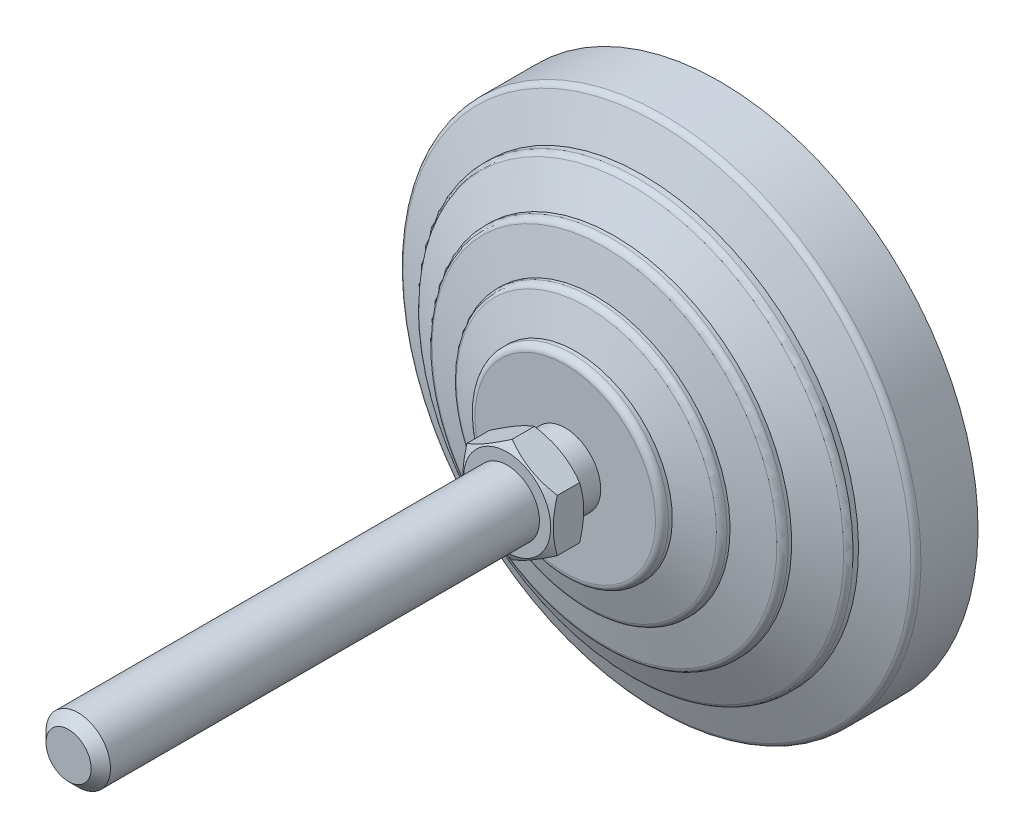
ISO-10303-21;
HEADER;
FILE_DESCRIPTION(('STEP AP214'),'2;1');
FILE_NAME('part.step','',(''),(''),'','','');
FILE_SCHEMA(('AUTOMOTIVE_DESIGN { 1 0 10303 214 1 1 1 1 }'));
ENDSEC;
DATA;
#1=APPLICATION_CONTEXT('core data for automotive mechanical design processes');
#2=APPLICATION_PROTOCOL_DEFINITION('international standard','automotive_design',2000,#1);
#3=PRODUCT_CONTEXT('',#1,'mechanical');
#4=PRODUCT('Part','Part','',(#3));
#5=PRODUCT_RELATED_PRODUCT_CATEGORY('part','',(#4));
#6=PRODUCT_DEFINITION_FORMATION('','',#4);
#7=PRODUCT_DEFINITION_CONTEXT('part definition',#1,'design');
#8=PRODUCT_DEFINITION('design','',#6,#7);
#9=PRODUCT_DEFINITION_SHAPE('','',#8);
#10=(LENGTH_UNIT() NAMED_UNIT(*) SI_UNIT(.MILLI.,.METRE.));
#11=(NAMED_UNIT(*) PLANE_ANGLE_UNIT() SI_UNIT($,.RADIAN.));
#12=(NAMED_UNIT(*) SI_UNIT($,.STERADIAN.) SOLID_ANGLE_UNIT());
#13=UNCERTAINTY_MEASURE_WITH_UNIT(LENGTH_MEASURE(1.E-05),#10,'distance_accuracy_value','');
#14=(GEOMETRIC_REPRESENTATION_CONTEXT(3) GLOBAL_UNCERTAINTY_ASSIGNED_CONTEXT((#13)) GLOBAL_UNIT_ASSIGNED_CONTEXT((#10,
#11,#12)) REPRESENTATION_CONTEXT('',''));
#15=CARTESIAN_POINT('',(0.,0.,0.));
#16=DIRECTION('',(0.,0.,1.));
#17=DIRECTION('',(1.,0.,0.));
#18=AXIS2_PLACEMENT_3D('',#15,#16,#17);
#19=CARTESIAN_POINT('',(-5.50000000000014,0.,28.));
#20=DIRECTION('',(0.,0.,1.));
#21=DIRECTION('',(0.,-1.,0.));
#22=AXIS2_PLACEMENT_3D('',#19,#20,#21);
#23=PLANE('',#22);
#24=CARTESIAN_POINT('',(0.,0.,28.));
#25=DIRECTION('',(0.,0.,-1.));
#26=DIRECTION('',(-1.,0.,0.));
#27=AXIS2_PLACEMENT_3D('',#24,#25,#26);
#28=CIRCLE('',#27,6.75);
#29=CARTESIAN_POINT('',(-6.75,0.,28.));
#30=VERTEX_POINT('',#29);
#31=EDGE_CURVE('E311',#30,#30,#28,.T.);
#32=ORIENTED_EDGE('',*,*,#31,.T.);
#33=EDGE_LOOP('',(#32));
#34=FACE_BOUND('',#33,.T.);
#35=CARTESIAN_POINT('',(0.,0.,28.));
#36=DIRECTION('',(0.,0.,-1.));
#37=DIRECTION('',(0.,1.,0.));
#38=AXIS2_PLACEMENT_3D('',#35,#36,#37);
#39=CIRCLE('',#38,5.50000000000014);
#40=CARTESIAN_POINT('',(0.,5.50000000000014,28.));
#41=VERTEX_POINT('',#40);
#42=EDGE_CURVE('E150',#41,#41,#39,.T.);
#43=ORIENTED_EDGE('',*,*,#42,.F.);
#44=EDGE_LOOP('',(#43));
#45=FACE_BOUND('',#44,.T.);
#46=ADVANCED_FACE('F14',(#34,#45),#23,.F.);
#47=CARTESIAN_POINT('',(0.,0.,0.));
#48=DIRECTION('',(0.,0.,-1.));
#49=DIRECTION('',(0.,1.,0.));
#50=AXIS2_PLACEMENT_3D('',#47,#48,#49);
#51=CYLINDRICAL_SURFACE('',#50,5.50000000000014);
#52=CARTESIAN_POINT('',(0.,0.,24.));
#53=DIRECTION('',(0.,0.,-1.));
#54=DIRECTION('',(0.,1.,0.));
#55=AXIS2_PLACEMENT_3D('',#52,#53,#54);
#56=CIRCLE('',#55,5.50000000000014);
#57=CARTESIAN_POINT('',(0.,5.50000000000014,24.));
#58=VERTEX_POINT('',#57);
#59=EDGE_CURVE('E147',#58,#58,#56,.T.);
#60=ORIENTED_EDGE('',*,*,#59,.F.);
#61=EDGE_LOOP('',(#60));
#62=FACE_BOUND('',#61,.T.);
#63=ORIENTED_EDGE('',*,*,#42,.T.);
#64=EDGE_LOOP('',(#63));
#65=FACE_BOUND('',#64,.T.);
#66=ADVANCED_FACE('F178',(#62,#65),#51,.T.);
#67=CARTESIAN_POINT('',(-5.50000000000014,0.,24.));
#68=DIRECTION('',(0.,0.,-1.));
#69=DIRECTION('',(0.,1.,0.));
#70=AXIS2_PLACEMENT_3D('',#67,#68,#69);
#71=PLANE('',#70);
#72=CARTESIAN_POINT('',(0.,0.,24.));
#73=DIRECTION('',(0.,0.,-1.));
#74=DIRECTION('',(0.,1.,0.));
#75=AXIS2_PLACEMENT_3D('',#72,#73,#74);
#76=CIRCLE('',#75,14.);
#77=CARTESIAN_POINT('',(0.,14.,24.));
#78=VERTEX_POINT('',#77);
#79=EDGE_CURVE('E144',#78,#78,#76,.T.);
#80=ORIENTED_EDGE('',*,*,#79,.F.);
#81=EDGE_LOOP('',(#80));
#82=FACE_BOUND('',#81,.T.);
#83=ORIENTED_EDGE('',*,*,#59,.T.);
#84=EDGE_LOOP('',(#83));
#85=FACE_BOUND('',#84,.T.);
#86=ADVANCED_FACE('F185',(#82,#85),#71,.F.);
#87=CARTESIAN_POINT('',(0.,0.,23.));
#88=DIRECTION('',(0.,0.,-1.));
#89=DIRECTION('',(0.,1.,0.));
#90=AXIS2_PLACEMENT_3D('',#87,#88,#89);
#91=TOROIDAL_SURFACE('',#90,14.,1.);
#92=CARTESIAN_POINT('',(0.,0.,23.));
#93=DIRECTION('',(0.,0.,-1.));
#94=DIRECTION('',(0.,1.,0.));
#95=AXIS2_PLACEMENT_3D('',#92,#93,#94);
#96=CIRCLE('',#95,15.);
#97=CARTESIAN_POINT('',(0.,15.,23.));
#98=VERTEX_POINT('',#97);
#99=EDGE_CURVE('E141',#98,#98,#96,.T.);
#100=ORIENTED_EDGE('',*,*,#99,.F.);
#101=EDGE_LOOP('',(#100));
#102=FACE_BOUND('',#101,.T.);
#103=ORIENTED_EDGE('',*,*,#79,.T.);
#104=EDGE_LOOP('',(#103));
#105=FACE_BOUND('',#104,.T.);
#106=ADVANCED_FACE('F524',(#102,#105),#91,.T.);
#107=CARTESIAN_POINT('',(0.,0.,0.));
#108=DIRECTION('',(0.,0.,-1.));
#109=DIRECTION('',(0.,1.,0.));
#110=AXIS2_PLACEMENT_3D('',#107,#108,#109);
#111=CYLINDRICAL_SURFACE('',#110,15.);
#112=CARTESIAN_POINT('',(0.,0.,22.4025287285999));
#113=DIRECTION('',(0.,0.,-1.));
#114=DIRECTION('',(0.,1.,0.));
#115=AXIS2_PLACEMENT_3D('',#112,#113,#114);
#116=CIRCLE('',#115,15.);
#117=CARTESIAN_POINT('',(0.,15.,22.4025287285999));
#118=VERTEX_POINT('',#117);
#119=EDGE_CURVE('E138',#118,#118,#116,.T.);
#120=ORIENTED_EDGE('',*,*,#119,.F.);
#121=EDGE_LOOP('',(#120));
#122=FACE_BOUND('',#121,.T.);
#123=ORIENTED_EDGE('',*,*,#99,.T.);
#124=EDGE_LOOP('',(#123));
#125=FACE_BOUND('',#124,.T.);
#126=ADVANCED_FACE('F515',(#122,#125),#111,.T.);
#127=CARTESIAN_POINT('',(0.,0.,22.4025287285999));
#128=DIRECTION('',(0.,0.,-1.));
#129=DIRECTION('',(0.,1.,0.));
#130=AXIS2_PLACEMENT_3D('',#127,#128,#129);
#131=CONICAL_SURFACE('',#130,15.,1.25589726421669);
#132=CARTESIAN_POINT('',(0.,0.,20.7216684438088));
#133=DIRECTION('',(0.,0.,-1.));
#134=DIRECTION('',(0.,1.,0.));
#135=AXIS2_PLACEMENT_3D('',#132,#133,#134);
#136=CIRCLE('',#135,20.1601635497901);
#137=CARTESIAN_POINT('',(0.,20.1601635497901,20.7216684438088));
#138=VERTEX_POINT('',#137);
#139=EDGE_CURVE('E135',#138,#138,#136,.T.);
#140=ORIENTED_EDGE('',*,*,#139,.F.);
#141=EDGE_LOOP('',(#140));
#142=FACE_BOUND('',#141,.T.);
#143=ORIENTED_EDGE('',*,*,#119,.T.);
#144=EDGE_LOOP('',(#143));
#145=FACE_BOUND('',#144,.T.);
#146=ADVANCED_FACE('F506',(#142,#145),#131,.T.);
#147=CARTESIAN_POINT('',(0.,0.,19.7708407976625));
#148=DIRECTION('',(0.,0.,-1.));
#149=DIRECTION('',(0.,1.,0.));
#150=AXIS2_PLACEMENT_3D('',#147,#148,#149);
#151=TOROIDAL_SURFACE('',#150,19.8504430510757,1.);
#152=CARTESIAN_POINT('',(0.,0.,19.7708407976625));
#153=DIRECTION('',(0.,0.,-1.));
#154=DIRECTION('',(0.,1.,0.));
#155=AXIS2_PLACEMENT_3D('',#152,#153,#154);
#156=CIRCLE('',#155,20.8504430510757);
#157=CARTESIAN_POINT('',(0.,20.8504430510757,19.7708407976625));
#158=VERTEX_POINT('',#157);
#159=EDGE_CURVE('E132',#158,#158,#156,.T.);
#160=ORIENTED_EDGE('',*,*,#159,.F.);
#161=EDGE_LOOP('',(#160));
#162=FACE_BOUND('',#161,.T.);
#163=ORIENTED_EDGE('',*,*,#139,.T.);
#164=EDGE_LOOP('',(#163));
#165=FACE_BOUND('',#164,.T.);
#166=ADVANCED_FACE('F497',(#162,#165),#151,.T.);
#167=CARTESIAN_POINT('',(0.,0.,0.));
#168=DIRECTION('',(0.,0.,-1.));
#169=DIRECTION('',(0.,1.,0.));
#170=AXIS2_PLACEMENT_3D('',#167,#168,#169);
#171=CYLINDRICAL_SURFACE('',#170,20.8504430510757);
#172=CARTESIAN_POINT('',(0.,0.,19.2987385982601));
#173=DIRECTION('',(0.,0.,-1.));
#174=DIRECTION('',(0.,1.,0.));
#175=AXIS2_PLACEMENT_3D('',#172,#173,#174);
#176=CIRCLE('',#175,20.8504430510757);
#177=CARTESIAN_POINT('',(0.,20.8504430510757,19.2987385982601));
#178=VERTEX_POINT('',#177);
#179=EDGE_CURVE('E129',#178,#178,#176,.T.);
#180=ORIENTED_EDGE('',*,*,#179,.F.);
#181=EDGE_LOOP('',(#180));
#182=FACE_BOUND('',#181,.T.);
#183=ORIENTED_EDGE('',*,*,#159,.T.);
#184=EDGE_LOOP('',(#183));
#185=FACE_BOUND('',#184,.T.);
#186=ADVANCED_FACE('F488',(#182,#185),#171,.T.);
#187=CARTESIAN_POINT('',(0.,0.,19.2987385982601));
#188=DIRECTION('',(0.,0.,-1.));
#189=DIRECTION('',(0.,1.,0.));
#190=AXIS2_PLACEMENT_3D('',#187,#188,#189);
#191=CONICAL_SURFACE('',#190,20.8504430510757,1.34067144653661);
#192=CARTESIAN_POINT('',(0.,0.,17.9217501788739));
#193=DIRECTION('',(0.,0.,-1.));
#194=DIRECTION('',(0.,1.,0.));
#195=AXIS2_PLACEMENT_3D('',#192,#193,#194);
#196=CIRCLE('',#195,26.7280991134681);
#197=CARTESIAN_POINT('',(0.,26.7280991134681,17.9217501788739));
#198=VERTEX_POINT('',#197);
#199=EDGE_CURVE('E126',#198,#198,#196,.T.);
#200=ORIENTED_EDGE('',*,*,#199,.F.);
#201=EDGE_LOOP('',(#200));
#202=FACE_BOUND('',#201,.T.);
#203=ORIENTED_EDGE('',*,*,#179,.T.);
#204=EDGE_LOOP('',(#203));
#205=FACE_BOUND('',#204,.T.);
#206=ADVANCED_FACE('F479',(#202,#205),#191,.T.);
#207=CARTESIAN_POINT('',(0.,0.,16.9481122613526));
#208=DIRECTION('',(0.,0.,-1.));
#209=DIRECTION('',(0.,1.,0.));
#210=AXIS2_PLACEMENT_3D('',#207,#208,#209);
#211=TOROIDAL_SURFACE('',#210,26.5,1.);
#212=CARTESIAN_POINT('',(0.,0.,16.9481122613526));
#213=DIRECTION('',(0.,0.,-1.));
#214=DIRECTION('',(0.,1.,0.));
#215=AXIS2_PLACEMENT_3D('',#212,#213,#214);
#216=CIRCLE('',#215,27.5);
#217=CARTESIAN_POINT('',(0.,27.5,16.9481122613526));
#218=VERTEX_POINT('',#217);
#219=EDGE_CURVE('E123',#218,#218,#216,.T.);
#220=ORIENTED_EDGE('',*,*,#219,.F.);
#221=EDGE_LOOP('',(#220));
#222=FACE_BOUND('',#221,.T.);
#223=ORIENTED_EDGE('',*,*,#199,.T.);
#224=EDGE_LOOP('',(#223));
#225=FACE_BOUND('',#224,.T.);
#226=ADVANCED_FACE('F470',(#222,#225),#211,.T.);
#227=CARTESIAN_POINT('',(0.,0.,0.));
#228=DIRECTION('',(0.,0.,-1.));
#229=DIRECTION('',(0.,1.,0.));
#230=AXIS2_PLACEMENT_3D('',#227,#228,#229);
#231=CYLINDRICAL_SURFACE('',#230,27.5);
#232=CARTESIAN_POINT('',(0.,0.,16.4025287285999));
#233=DIRECTION('',(0.,0.,-1.));
#234=DIRECTION('',(0.,1.,0.));
#235=AXIS2_PLACEMENT_3D('',#232,#233,#234);
#236=CIRCLE('',#235,27.5);
#237=CARTESIAN_POINT('',(0.,27.5,16.4025287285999));
#238=VERTEX_POINT('',#237);
#239=EDGE_CURVE('E120',#238,#238,#236,.T.);
#240=ORIENTED_EDGE('',*,*,#239,.F.);
#241=EDGE_LOOP('',(#240));
#242=FACE_BOUND('',#241,.T.);
#243=ORIENTED_EDGE('',*,*,#219,.T.);
#244=EDGE_LOOP('',(#243));
#245=FACE_BOUND('',#244,.T.);
#246=ADVANCED_FACE('F461',(#242,#245),#231,.T.);
#247=CARTESIAN_POINT('',(0.,0.,16.4025287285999));
#248=DIRECTION('',(0.,0.,-1.));
#249=DIRECTION('',(0.,1.,0.));
#250=AXIS2_PLACEMENT_3D('',#247,#248,#249);
#251=CONICAL_SURFACE('',#250,27.5,1.12022914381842);
#252=CARTESIAN_POINT('',(0.,0.,13.7730910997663));
#253=DIRECTION('',(0.,0.,-1.));
#254=DIRECTION('',(0.,1.,0.));
#255=AXIS2_PLACEMENT_3D('',#252,#253,#254);
#256=CIRCLE('',#255,32.9354761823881);
#257=CARTESIAN_POINT('',(0.,32.9354761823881,13.7730910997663));
#258=VERTEX_POINT('',#257);
#259=EDGE_CURVE('E117',#258,#258,#256,.T.);
#260=ORIENTED_EDGE('',*,*,#259,.F.);
#261=EDGE_LOOP('',(#260));
#262=FACE_BOUND('',#261,.T.);
#263=ORIENTED_EDGE('',*,*,#239,.T.);
#264=EDGE_LOOP('',(#263));
#265=FACE_BOUND('',#264,.T.);
#266=ADVANCED_FACE('F452',(#262,#265),#251,.T.);
#267=CARTESIAN_POINT('',(0.,0.,12.872890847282));
#268=DIRECTION('',(0.,0.,-1.));
#269=DIRECTION('',(0.,1.,0.));
#270=AXIS2_PLACEMENT_3D('',#267,#268,#269);
#271=TOROIDAL_SURFACE('',#270,32.5,1.);
#272=CARTESIAN_POINT('',(0.,0.,12.872890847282));
#273=DIRECTION('',(0.,0.,-1.));
#274=DIRECTION('',(0.,1.,0.));
#275=AXIS2_PLACEMENT_3D('',#272,#273,#274);
#276=CIRCLE('',#275,33.5);
#277=CARTESIAN_POINT('',(0.,33.5,12.872890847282));
#278=VERTEX_POINT('',#277);
#279=EDGE_CURVE('E114',#278,#278,#276,.T.);
#280=ORIENTED_EDGE('',*,*,#279,.F.);
#281=EDGE_LOOP('',(#280));
#282=FACE_BOUND('',#281,.T.);
#283=ORIENTED_EDGE('',*,*,#259,.T.);
#284=EDGE_LOOP('',(#283));
#285=FACE_BOUND('',#284,.T.);
#286=ADVANCED_FACE('F443',(#282,#285),#271,.T.);
#287=CARTESIAN_POINT('',(0.,0.,0.));
#288=DIRECTION('',(0.,0.,-1.));
#289=DIRECTION('',(0.,1.,0.));
#290=AXIS2_PLACEMENT_3D('',#287,#288,#289);
#291=CYLINDRICAL_SURFACE('',#290,33.5);
#292=CARTESIAN_POINT('',(0.,0.,12.0315037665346));
#293=DIRECTION('',(0.,0.,-1.));
#294=DIRECTION('',(0.,1.,0.));
#295=AXIS2_PLACEMENT_3D('',#292,#293,#294);
#296=CIRCLE('',#295,33.5);
#297=CARTESIAN_POINT('',(0.,33.5,12.0315037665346));
#298=VERTEX_POINT('',#297);
#299=EDGE_CURVE('E111',#298,#298,#296,.T.);
#300=ORIENTED_EDGE('',*,*,#299,.F.);
#301=EDGE_LOOP('',(#300));
#302=FACE_BOUND('',#301,.T.);
#303=ORIENTED_EDGE('',*,*,#279,.T.);
#304=EDGE_LOOP('',(#303));
#305=FACE_BOUND('',#304,.T.);
#306=ADVANCED_FACE('F434',(#302,#305),#291,.T.);
#307=CARTESIAN_POINT('',(0.,0.,12.0315037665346));
#308=DIRECTION('',(0.,0.,-1.));
#309=DIRECTION('',(0.,1.,0.));
#310=AXIS2_PLACEMENT_3D('',#307,#308,#309);
#311=CONICAL_SURFACE('',#310,33.5,1.20362249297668);
#312=CARTESIAN_POINT('',(0.,0.,9.77805027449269));
#313=DIRECTION('',(0.,0.,-1.));
#314=DIRECTION('',(0.,1.,0.));
#315=AXIS2_PLACEMENT_3D('',#312,#313,#314);
#316=CIRCLE('',#315,39.358979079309);
#317=CARTESIAN_POINT('',(0.,39.358979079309,9.77805027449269));
#318=VERTEX_POINT('',#317);
#319=EDGE_CURVE('E108',#318,#318,#316,.T.);
#320=ORIENTED_EDGE('',*,*,#319,.F.);
#321=EDGE_LOOP('',(#320));
#322=FACE_BOUND('',#321,.T.);
#323=ORIENTED_EDGE('',*,*,#299,.T.);
#324=EDGE_LOOP('',(#323));
#325=FACE_BOUND('',#324,.T.);
#326=ADVANCED_FACE('F425',(#322,#325),#311,.T.);
#327=CARTESIAN_POINT('',(0.,0.,8.84470466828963));
#328=DIRECTION('',(0.,0.,-1.));
#329=DIRECTION('',(0.,1.,0.));
#330=AXIS2_PLACEMENT_3D('',#327,#328,#329);
#331=TOROIDAL_SURFACE('',#330,39.,1.);
#332=CARTESIAN_POINT('',(0.,0.,8.84470466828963));
#333=DIRECTION('',(0.,0.,-1.));
#334=DIRECTION('',(0.,1.,0.));
#335=AXIS2_PLACEMENT_3D('',#332,#333,#334);
#336=CIRCLE('',#335,40.);
#337=CARTESIAN_POINT('',(0.,40.,8.84470466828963));
#338=VERTEX_POINT('',#337);
#339=EDGE_CURVE('E105',#338,#338,#336,.T.);
#340=ORIENTED_EDGE('',*,*,#339,.F.);
#341=EDGE_LOOP('',(#340));
#342=FACE_BOUND('',#341,.T.);
#343=ORIENTED_EDGE('',*,*,#319,.T.);
#344=EDGE_LOOP('',(#343));
#345=FACE_BOUND('',#344,.T.);
#346=ADVANCED_FACE('F416',(#342,#345),#331,.T.);
#347=CARTESIAN_POINT('',(0.,0.,0.));
#348=DIRECTION('',(0.,0.,-1.));
#349=DIRECTION('',(0.,1.,0.));
#350=AXIS2_PLACEMENT_3D('',#347,#348,#349);
#351=CYLINDRICAL_SURFACE('',#350,40.);
#352=CARTESIAN_POINT('',(0.,0.,0.));
#353=DIRECTION('',(0.,0.,-1.));
#354=DIRECTION('',(0.,1.,0.));
#355=AXIS2_PLACEMENT_3D('',#352,#353,#354);
#356=CIRCLE('',#355,40.);
#357=CARTESIAN_POINT('',(0.,40.,0.));
#358=VERTEX_POINT('',#357);
#359=EDGE_CURVE('E102',#358,#358,#356,.T.);
#360=ORIENTED_EDGE('',*,*,#359,.F.);
#361=EDGE_LOOP('',(#360));
#362=FACE_BOUND('',#361,.T.);
#363=ORIENTED_EDGE('',*,*,#339,.T.);
#364=EDGE_LOOP('',(#363));
#365=FACE_BOUND('',#364,.T.);
#366=ADVANCED_FACE('F409',(#362,#365),#351,.T.);
#367=CARTESIAN_POINT('',(0.,0.,0.));
#368=DIRECTION('',(0.,0.,1.));
#369=DIRECTION('',(0.,-1.,0.));
#370=AXIS2_PLACEMENT_3D('',#367,#368,#369);
#371=PLANE('',#370);
#372=ORIENTED_EDGE('',*,*,#359,.T.);
#373=EDGE_LOOP('',(#372));
#374=FACE_BOUND('',#373,.T.);
#375=ADVANCED_FACE('F175',(#374),#371,.F.);
#376=CARTESIAN_POINT('',(0.,0.,29.6217974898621));
#377=DIRECTION('',(0.,0.,1.));
#378=DIRECTION('',(1.,0.,0.));
#379=AXIS2_PLACEMENT_3D('',#376,#377,#378);
#380=CONICAL_SURFACE('',#379,9.55903565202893,1.0471975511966);
#381=CARTESIAN_POINT('',(0.000200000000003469,-8.0830192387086,28.7696190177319));
#382=CARTESIAN_POINT('',(-0.153667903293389,-7.99418356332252,28.7183374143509));
#383=CARTESIAN_POINT('',(-0.308109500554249,-7.90501666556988,28.669383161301));
#384=CARTESIAN_POINT('',(-0.618246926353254,-7.72595873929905,28.5767703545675));
#385=CARTESIAN_POINT('',(-0.773943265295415,-7.63606741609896,28.5331140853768));
#386=CARTESIAN_POINT('',(-1.24352516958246,-7.36495417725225,28.4109491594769));
#387=CARTESIAN_POINT('',(-1.5592643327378,-7.18266208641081,28.3414631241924));
#388=CARTESIAN_POINT('',(-2.03176224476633,-6.90986528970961,28.2599825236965));
#389=CARTESIAN_POINT('',(-2.18710922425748,-6.82017566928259,28.2367710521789));
#390=CARTESIAN_POINT('',(-2.49850511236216,-6.64039116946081,28.1978487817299));
#391=CARTESIAN_POINT('',(-2.65455395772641,-6.55029632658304,28.1821373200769));
#392=CARTESIAN_POINT('',(-2.96692267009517,-6.36995016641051,28.1586154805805));
#393=CARTESIAN_POINT('',(-3.12324202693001,-6.27969914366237,28.1507961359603));
#394=CARTESIAN_POINT('',(-3.43601650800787,-6.09911871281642,28.1432178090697));
#395=CARTESIAN_POINT('',(-3.59247162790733,-6.00878930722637,28.1434585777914));
#396=CARTESIAN_POINT('',(-4.02110687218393,-5.76131663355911,28.155197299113));
#397=CARTESIAN_POINT('',(-4.2931466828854,-5.60425437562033,28.1749033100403));
#398=CARTESIAN_POINT('',(-4.8354194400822,-5.29117305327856,28.2373910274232));
#399=CARTESIAN_POINT('',(-5.10565047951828,-5.13515508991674,28.2801940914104));
#400=CARTESIAN_POINT('',(-5.64901454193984,-4.82144370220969,28.3871892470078));
#401=CARTESIAN_POINT('',(-5.92207900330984,-4.6637898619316,28.4518346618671));
#402=CARTESIAN_POINT('',(-6.46413578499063,-4.35083323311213,28.5985536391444));
#403=CARTESIAN_POINT('',(-6.73313504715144,-4.19552643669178,28.680592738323));
#404=CARTESIAN_POINT('',(-7.0002,-4.04133641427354,28.7696190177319));
#405=B_SPLINE_CURVE_WITH_KNOTS('',3,(#381,#382,#383,#384,#385,#386,#387,#388,#389,#390,#391,
#392,#393,#394,#395,#396,#397,#398,#399,#400,#401,#402,#403,#404),.UNSPECIFIED.,.F.,.F.,(4,2,2,
2,2,2,2,2,2,2,2,4),(0.,0.554727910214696,1.10969417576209,2.2219327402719,2.76443041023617,
3.30688013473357,3.8487128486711,4.39052882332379,5.33376515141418,6.27787517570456,
7.2429241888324,8.20607866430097),.UNSPECIFIED.);
#406=CARTESIAN_POINT('',(0.,-8.08290376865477,28.7695523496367));
#407=VERTEX_POINT('',#406);
#408=CARTESIAN_POINT('',(-7.,-4.04145188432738,28.7695523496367));
#409=VERTEX_POINT('',#408);
#410=EDGE_CURVE('E73',#407,#409,#405,.T.);
#411=ORIENTED_EDGE('',*,*,#410,.T.);
#412=CARTESIAN_POINT('',(-7.,-10.8170261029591,31.5417039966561));
#413=CARTESIAN_POINT('',(-7.,-10.5116122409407,31.3937073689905));
#414=CARTESIAN_POINT('',(-7.,-10.2054930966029,31.2471410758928));
#415=CARTESIAN_POINT('',(-7.,-9.59146901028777,30.95767440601));
#416=CARTESIAN_POINT('',(-7.,-9.28356379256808,30.8147746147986));
#417=CARTESIAN_POINT('',(-7.,-8.66398721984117,30.5327189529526));
#418=CARTESIAN_POINT('',(-7.,-8.35230446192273,30.393588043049));
#419=CARTESIAN_POINT('',(-7.,-7.72644633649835,30.1210720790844));
#420=CARTESIAN_POINT('',(-7.,-7.4122710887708,29.9876867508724));
#421=CARTESIAN_POINT('',(-7.,-6.77094025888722,29.7240748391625));
#422=CARTESIAN_POINT('',(-7.,-6.44368830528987,29.594081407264));
#423=CARTESIAN_POINT('',(-7.,-5.78534226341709,29.3440272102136));
#424=CARTESIAN_POINT('',(-7.,-5.45424774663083,29.2239675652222));
#425=CARTESIAN_POINT('',(-7.,-4.78831817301,28.9969615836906));
#426=CARTESIAN_POINT('',(-7.,-4.45349238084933,28.889988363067));
#427=CARTESIAN_POINT('',(-7.,-3.77905036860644,28.692611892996));
#428=CARTESIAN_POINT('',(-7.,-3.43943570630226,28.6022033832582));
#429=CARTESIAN_POINT('',(-7.,-2.75704263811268,28.4428050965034));
#430=CARTESIAN_POINT('',(-7.,-2.41429174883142,28.3737007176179));
#431=CARTESIAN_POINT('',(-7.,-1.89707551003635,28.2890336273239));
#432=CARTESIAN_POINT('',(-7.,-1.72414211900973,28.2639750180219));
#433=CARTESIAN_POINT('',(-7.,-1.37742903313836,28.2206800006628));
#434=CARTESIAN_POINT('',(-7.,-1.20364942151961,28.2024429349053));
#435=CARTESIAN_POINT('',(-7.,-0.857729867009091,28.173381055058));
#436=CARTESIAN_POINT('',(-7.,-0.685597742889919,28.1624635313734));
#437=CARTESIAN_POINT('',(-7.,-0.341026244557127,28.1479146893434));
#438=CARTESIAN_POINT('',(-7.,-0.168586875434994,28.1442832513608));
#439=CARTESIAN_POINT('',(-7.,0.176291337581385,28.1443931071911));
#440=CARTESIAN_POINT('',(-7.,0.348730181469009,28.1481344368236));
#441=CARTESIAN_POINT('',(-7.,0.693298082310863,28.1628990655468));
#442=CARTESIAN_POINT('',(-7.,0.865427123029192,28.1739227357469));
#443=CARTESIAN_POINT('',(-7.,1.28028864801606,28.2090358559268));
#444=CARTESIAN_POINT('',(-7.,1.5227292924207,28.236646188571));
#445=CARTESIAN_POINT('',(-7.,2.0057741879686,28.3047982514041));
#446=CARTESIAN_POINT('',(-7.,2.24637818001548,28.3453417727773));
#447=CARTESIAN_POINT('',(-7.,2.96518083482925,28.4842190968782));
#448=CARTESIAN_POINT('',(-7.,3.44009436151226,28.5997732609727));
#449=CARTESIAN_POINT('',(-7.,4.15016728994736,28.7996895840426));
#450=CARTESIAN_POINT('',(-7.,4.38902144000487,28.87167931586));
#451=CARTESIAN_POINT('',(-7.,4.86440901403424,29.0230200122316));
#452=CARTESIAN_POINT('',(-7.,5.10094242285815,29.1023710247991));
#453=CARTESIAN_POINT('',(-7.,5.57176518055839,29.2671707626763));
#454=CARTESIAN_POINT('',(-7.,5.80605526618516,29.3526174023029));
#455=CARTESIAN_POINT('',(-7.,6.27270207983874,29.5286145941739));
#456=CARTESIAN_POINT('',(-7.,6.50505882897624,29.6191650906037));
#457=CARTESIAN_POINT('',(-7.,7.04711837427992,29.8361726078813));
#458=CARTESIAN_POINT('',(-7.,7.35613833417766,29.9643319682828));
#459=CARTESIAN_POINT('',(-7.,7.97160516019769,30.2267042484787));
#460=CARTESIAN_POINT('',(-7.,8.27805187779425,30.36091751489));
#461=CARTESIAN_POINT('',(-7.,8.88883728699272,30.6341994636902));
#462=CARTESIAN_POINT('',(-7.,9.19317556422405,30.7732690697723));
#463=CARTESIAN_POINT('',(-7.,9.8000436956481,31.0553064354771));
#464=CARTESIAN_POINT('',(-7.,10.1025735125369,31.1982742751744));
#465=CARTESIAN_POINT('',(-7.,10.7064204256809,31.4875319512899));
#466=CARTESIAN_POINT('',(-7.,11.0077359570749,31.6338250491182));
#467=CARTESIAN_POINT('',(-7.,11.6090807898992,31.929033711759));
#468=CARTESIAN_POINT('',(-7.,11.9091100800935,32.0779492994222));
#469=CARTESIAN_POINT('',(-7.,12.8074960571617,32.5279034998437));
#470=CARTESIAN_POINT('',(-7.,13.4042275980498,32.8321866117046));
#471=CARTESIAN_POINT('',(-7.,14.5456526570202,33.4216249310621));
#472=CARTESIAN_POINT('',(-7.,15.0905956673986,33.706299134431));
#473=CARTESIAN_POINT('',(-7.,16.1784519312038,34.2795407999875));
#474=CARTESIAN_POINT('',(-7.,16.7213651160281,34.5681083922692));
#475=CARTESIAN_POINT('',(-7.,17.8042998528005,35.1475176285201));
#476=CARTESIAN_POINT('',(-7.,18.344325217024,35.4383521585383));
#477=CARTESIAN_POINT('',(-7.,19.4230745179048,36.022357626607));
#478=CARTESIAN_POINT('',(-7.,19.9617985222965,36.3155284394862));
#479=CARTESIAN_POINT('',(-7.,20.5000417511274,36.6095733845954));
#480=B_SPLINE_CURVE_WITH_KNOTS('',3,(#412,#413,#414,#415,#416,#417,#418,#419,#420,#421,#422,
#423,#424,#425,#426,#427,#428,#429,#430,#431,#432,#433,#434,#435,#436,#437,#438,#439,#440,#441,
#442,#443,#444,#445,#446,#447,#448,#449,#450,#451,#452,#453,#454,#455,#456,#457,#458,#459,#460,
#461,#462,#463,#464,#465,#466,#467,#468,#469,#470,#471,#472,#473,#474,#475,#476,#477,#478,#479),
.UNSPECIFIED.,.F.,.F.,(4,2,2,2,2,2,2,2,2,2,2,2,2,2,2,2,2,2,2,2,2,2,2,2,2,2,2,2,2,2,2,2,2,4),(0.,
1.01816077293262,2.0364831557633,3.06041520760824,4.08429834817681,5.14054874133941,
6.19691807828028,7.25107946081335,8.30490550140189,9.35295955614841,9.87706465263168,
10.4011192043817,10.9184039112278,11.4356801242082,11.9529588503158,12.4702639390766,
13.2018730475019,13.9335835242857,15.3978319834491,16.1461722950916,16.8945174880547,
17.6426078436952,18.3906900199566,19.394228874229,20.3978252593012,21.4016135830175,
22.4054225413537,23.4102625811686,24.4151113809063,26.4245533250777,28.2689932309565,
30.1134949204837,31.9535727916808,33.7935527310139),.UNSPECIFIED.);
#481=CARTESIAN_POINT('',(-7.,4.04145188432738,28.7695523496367));
#482=VERTEX_POINT('',#481);
#483=EDGE_CURVE('E81',#409,#482,#480,.T.);
#484=ORIENTED_EDGE('',*,*,#483,.T.);
#485=CARTESIAN_POINT('',(-7.0002,4.04133641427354,28.7696190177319));
#486=CARTESIAN_POINT('',(-6.84633209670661,4.13017208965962,28.7183374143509));
#487=CARTESIAN_POINT('',(-6.69189049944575,4.21933898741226,28.669383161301));
#488=CARTESIAN_POINT('',(-6.38175307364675,4.39839691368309,28.5767703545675));
#489=CARTESIAN_POINT('',(-6.22605673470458,4.48828823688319,28.5331140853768));
#490=CARTESIAN_POINT('',(-5.75647483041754,4.75940147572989,28.4109491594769));
#491=CARTESIAN_POINT('',(-5.4407356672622,4.94169356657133,28.3414631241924));
#492=CARTESIAN_POINT('',(-4.96823775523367,5.21449036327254,28.2599825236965));
#493=CARTESIAN_POINT('',(-4.81289077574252,5.30417998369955,28.2367710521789));
#494=CARTESIAN_POINT('',(-4.50149488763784,5.48396448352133,28.1978487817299));
#495=CARTESIAN_POINT('',(-4.34544604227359,5.57405932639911,28.1821373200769));
#496=CARTESIAN_POINT('',(-4.03307732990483,5.75440548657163,28.1586154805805));
#497=CARTESIAN_POINT('',(-3.87675797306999,5.84465650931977,28.1507961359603));
#498=CARTESIAN_POINT('',(-3.56398349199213,6.02523694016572,28.1432178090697));
#499=CARTESIAN_POINT('',(-3.40752837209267,6.11556634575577,28.1434585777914));
#500=CARTESIAN_POINT('',(-2.97889312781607,6.36303901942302,28.155197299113));
#501=CARTESIAN_POINT('',(-2.7068533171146,6.52010127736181,28.1749033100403));
#502=CARTESIAN_POINT('',(-2.16458055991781,6.83318259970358,28.2373910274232));
#503=CARTESIAN_POINT('',(-1.89434952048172,6.9892005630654,28.2801940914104));
#504=CARTESIAN_POINT('',(-1.35098545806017,7.30291195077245,28.3871892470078));
#505=CARTESIAN_POINT('',(-1.07792099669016,7.46056579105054,28.4518346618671));
#506=CARTESIAN_POINT('',(-0.535864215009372,7.77352241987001,28.5985536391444));
#507=CARTESIAN_POINT('',(-0.266864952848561,7.92882921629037,28.680592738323));
#508=CARTESIAN_POINT('',(0.000199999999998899,8.0830192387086,28.7696190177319));
#509=B_SPLINE_CURVE_WITH_KNOTS('',3,(#485,#486,#487,#488,#489,#490,#491,#492,#493,#494,#495,
#496,#497,#498,#499,#500,#501,#502,#503,#504,#505,#506,#507,#508),.UNSPECIFIED.,.F.,.F.,(4,2,2,
2,2,2,2,2,2,2,2,4),(0.,0.554727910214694,1.10969417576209,2.2219327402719,2.76443041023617,
3.30688013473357,3.8487128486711,4.39052882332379,5.33376515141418,6.27787517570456,
7.2429241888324,8.20607866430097),.UNSPECIFIED.);
#510=CARTESIAN_POINT('',(0.,8.08290376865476,28.7695523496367));
#511=VERTEX_POINT('',#510);
#512=EDGE_CURVE('E278',#482,#511,#509,.T.);
#513=ORIENTED_EDGE('',*,*,#512,.T.);
#514=CARTESIAN_POINT('',(-0.000200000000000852,8.0830192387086,28.7696190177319));
#515=CARTESIAN_POINT('',(0.15366790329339,7.99418356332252,28.7183374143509));
#516=CARTESIAN_POINT('',(0.308109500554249,7.90501666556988,28.669383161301));
#517=CARTESIAN_POINT('',(0.618246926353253,7.72595873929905,28.5767703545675));
#518=CARTESIAN_POINT('',(0.773943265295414,7.63606741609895,28.5331140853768));
#519=CARTESIAN_POINT('',(1.24352516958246,7.36495417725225,28.4109491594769));
#520=CARTESIAN_POINT('',(1.5592643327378,7.18266208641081,28.3414631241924));
#521=CARTESIAN_POINT('',(2.03176224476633,6.9098652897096,28.2599825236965));
#522=CARTESIAN_POINT('',(2.18710922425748,6.82017566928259,28.2367710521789));
#523=CARTESIAN_POINT('',(2.49850511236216,6.64039116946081,28.1978487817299));
#524=CARTESIAN_POINT('',(2.6545539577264,6.55029632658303,28.1821373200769));
#525=CARTESIAN_POINT('',(2.96692267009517,6.36995016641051,28.1586154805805));
#526=CARTESIAN_POINT('',(3.12324202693,6.27969914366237,28.1507961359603));
#527=CARTESIAN_POINT('',(3.43601650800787,6.09911871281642,28.1432178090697));
#528=CARTESIAN_POINT('',(3.59247162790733,6.00878930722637,28.1434585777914));
#529=CARTESIAN_POINT('',(4.02110687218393,5.76131663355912,28.155197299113));
#530=CARTESIAN_POINT('',(4.2931466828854,5.60425437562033,28.1749033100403));
#531=CARTESIAN_POINT('',(4.83541944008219,5.29117305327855,28.2373910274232));
#532=CARTESIAN_POINT('',(5.10565047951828,5.13515508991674,28.2801940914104));
#533=CARTESIAN_POINT('',(5.64901454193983,4.82144370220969,28.3871892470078));
#534=CARTESIAN_POINT('',(5.92207900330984,4.66378986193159,28.4518346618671));
#535=CARTESIAN_POINT('',(6.46413578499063,4.35083323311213,28.5985536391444));
#536=CARTESIAN_POINT('',(6.73313504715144,4.19552643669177,28.680592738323));
#537=CARTESIAN_POINT('',(7.0002,4.04133641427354,28.7696190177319));
#538=B_SPLINE_CURVE_WITH_KNOTS('',3,(#514,#515,#516,#517,#518,#519,#520,#521,#522,#523,#524,
#525,#526,#527,#528,#529,#530,#531,#532,#533,#534,#535,#536,#537),.UNSPECIFIED.,.F.,.F.,(4,2,2,
2,2,2,2,2,2,2,2,4),(0.,0.554727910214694,1.10969417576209,2.2219327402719,2.76443041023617,
3.30688013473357,3.8487128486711,4.39052882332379,5.33376515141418,6.27787517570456,
7.2429241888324,8.20607866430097),.UNSPECIFIED.);
#539=CARTESIAN_POINT('',(7.,4.04145188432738,28.7695523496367));
#540=VERTEX_POINT('',#539);
#541=EDGE_CURVE('E279',#511,#540,#538,.T.);
#542=ORIENTED_EDGE('',*,*,#541,.T.);
#543=CARTESIAN_POINT('',(7.,-10.817026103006,31.5417039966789));
#544=CARTESIAN_POINT('',(7.,-10.511612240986,31.3937073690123));
#545=CARTESIAN_POINT('',(7.,-10.2054930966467,31.2471410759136));
#546=CARTESIAN_POINT('',(7.,-9.59146901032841,30.957674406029));
#547=CARTESIAN_POINT('',(7.,-9.28356379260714,30.8147746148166));
#548=CARTESIAN_POINT('',(7.,-8.66398721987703,30.5327189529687));
#549=CARTESIAN_POINT('',(7.,-8.35230446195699,30.3935880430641));
#550=CARTESIAN_POINT('',(7.,-7.72644633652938,30.1210720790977));
#551=CARTESIAN_POINT('',(7.,-7.41227108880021,29.9876867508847));
#552=CARTESIAN_POINT('',(7.,-6.77094025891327,29.7240748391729));
#553=CARTESIAN_POINT('',(7.,-6.44368830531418,29.5940814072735));
#554=CARTESIAN_POINT('',(7.,-5.7853422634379,29.3440272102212));
#555=CARTESIAN_POINT('',(7.,-5.45424774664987,29.223967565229));
#556=CARTESIAN_POINT('',(7.,-4.78831817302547,28.9969615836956));
#557=CARTESIAN_POINT('',(7.,-4.453492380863,28.8899883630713));
#558=CARTESIAN_POINT('',(7.,-3.77905036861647,28.6926118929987));
#559=CARTESIAN_POINT('',(7.,-3.43943570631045,28.6022033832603));
#560=CARTESIAN_POINT('',(7.,-2.7570426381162,28.4428050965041));
#561=CARTESIAN_POINT('',(7.,-2.41429174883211,28.373700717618));
#562=CARTESIAN_POINT('',(7.,-1.89707551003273,28.2890336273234));
#563=CARTESIAN_POINT('',(7.,-1.72414211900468,28.2639750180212));
#564=CARTESIAN_POINT('',(7.,-1.37742903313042,28.2206800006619));
#565=CARTESIAN_POINT('',(7.,-1.20364942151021,28.2024429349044));
#566=CARTESIAN_POINT('',(7.,-0.857729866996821,28.1733810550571));
#567=CARTESIAN_POINT('',(7.,-0.685597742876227,28.1624635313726));
#568=CARTESIAN_POINT('',(7.,-0.341026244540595,28.1479146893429));
#569=CARTESIAN_POINT('',(7.,-0.168586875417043,28.1442832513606));
#570=CARTESIAN_POINT('',(7.,0.176291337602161,28.1443931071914));
#571=CARTESIAN_POINT('',(7.,0.348730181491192,28.1481344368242));
#572=CARTESIAN_POINT('',(7.,0.69329808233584,28.1628990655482));
#573=CARTESIAN_POINT('',(7.,0.865427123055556,28.1739227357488));
#574=CARTESIAN_POINT('',(7.,1.28028864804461,28.2090358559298));
#575=CARTESIAN_POINT('',(7.,1.52272929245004,28.2366461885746));
#576=CARTESIAN_POINT('',(7.,2.00577418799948,28.304798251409));
#577=CARTESIAN_POINT('',(7.,2.24637818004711,28.3453417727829));
#578=CARTESIAN_POINT('',(7.,2.9651808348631,28.4842190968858));
#579=CARTESIAN_POINT('',(7.,3.44009436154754,28.5997732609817));
#580=CARTESIAN_POINT('',(7.,4.15016728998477,28.7996895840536));
#581=CARTESIAN_POINT('',(7.,4.38902144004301,28.8716793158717));
#582=CARTESIAN_POINT('',(7.,4.86440901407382,29.0230200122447));
#583=CARTESIAN_POINT('',(7.,5.10094242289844,29.1023710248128));
#584=CARTESIAN_POINT('',(7.,5.57176518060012,29.2671707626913));
#585=CARTESIAN_POINT('',(7.,5.8060552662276,29.3526174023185));
#586=CARTESIAN_POINT('',(7.,6.2727020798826,29.5286145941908));
#587=CARTESIAN_POINT('',(7.,6.50505882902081,29.6191650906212));
#588=CARTESIAN_POINT('',(7.,7.04711837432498,29.8361726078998));
#589=CARTESIAN_POINT('',(7.,7.35613833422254,29.9643319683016));
#590=CARTESIAN_POINT('',(7.,7.97160516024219,30.226704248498));
#591=CARTESIAN_POINT('',(7.,8.27805187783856,30.3609175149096));
#592=CARTESIAN_POINT('',(7.,8.8888372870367,30.6341994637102));
#593=CARTESIAN_POINT('',(7.,9.19317556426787,30.7732690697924));
#594=CARTESIAN_POINT('',(7.,9.80004369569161,31.0553064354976));
#595=CARTESIAN_POINT('',(7.,10.1025735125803,31.198274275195));
#596=CARTESIAN_POINT('',(7.,10.706420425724,31.4875319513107));
#597=CARTESIAN_POINT('',(7.,11.0077359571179,31.6338250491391));
#598=CARTESIAN_POINT('',(7.,11.6090807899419,31.9290337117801));
#599=CARTESIAN_POINT('',(7.,11.909110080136,32.0779492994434));
#600=CARTESIAN_POINT('',(7.,12.8074960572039,32.5279034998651));
#601=CARTESIAN_POINT('',(7.,13.4042275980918,32.8321866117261));
#602=CARTESIAN_POINT('',(7.,14.5456526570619,33.4216249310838));
#603=CARTESIAN_POINT('',(7.,15.0905956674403,33.7062991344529));
#604=CARTESIAN_POINT('',(7.,16.1784519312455,34.2795408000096));
#605=CARTESIAN_POINT('',(7.,16.7213651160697,34.5681083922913));
#606=CARTESIAN_POINT('',(7.,17.8042998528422,35.1475176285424));
#607=CARTESIAN_POINT('',(7.,18.3443252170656,35.4383521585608));
#608=CARTESIAN_POINT('',(7.,19.4230745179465,36.0223576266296));
#609=CARTESIAN_POINT('',(7.,19.9617985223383,36.3155284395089));
#610=CARTESIAN_POINT('',(7.,20.5000417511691,36.6095733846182));
#611=B_SPLINE_CURVE_WITH_KNOTS('',3,(#543,#544,#545,#546,#547,#548,#549,#550,#551,#552,#553,
#554,#555,#556,#557,#558,#559,#560,#561,#562,#563,#564,#565,#566,#567,#568,#569,#570,#571,#572,
#573,#574,#575,#576,#577,#578,#579,#580,#581,#582,#583,#584,#585,#586,#587,#588,#589,#590,#591,
#592,#593,#594,#595,#596,#597,#598,#599,#600,#601,#602,#603,#604,#605,#606,#607,#608,#609,#610),
.UNSPECIFIED.,.F.,.F.,(4,2,2,2,2,2,2,2,2,2,2,2,2,2,2,2,2,2,2,2,2,2,2,2,2,2,2,2,2,2,2,2,2,4),(0.,
1.01816077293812,2.03648315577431,3.06041520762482,4.08429834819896,5.14054874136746,
6.19691807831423,7.25107946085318,8.30490550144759,9.3529595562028,9.87706465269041,
10.4011192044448,10.9184039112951,11.4356801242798,11.9529588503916,12.4702639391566,
13.2018730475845,13.9335835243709,15.3978319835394,16.1461722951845,16.8945174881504,
17.6426078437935,18.3906900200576,19.3942288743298,20.3978252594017,21.4016135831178,
22.4054225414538,23.4102625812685,24.4151113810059,26.4245533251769,28.2689932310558,
30.1134949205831,31.9535727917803,33.7935527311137),.UNSPECIFIED.);
#612=CARTESIAN_POINT('',(7.,-4.04145188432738,28.7695523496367));
#613=VERTEX_POINT('',#612);
#614=EDGE_CURVE('E34',#540,#613,#611,.F.);
#615=ORIENTED_EDGE('',*,*,#614,.T.);
#616=CARTESIAN_POINT('',(7.0002,-4.04133641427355,28.7696190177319));
#617=CARTESIAN_POINT('',(6.84633209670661,-4.13017208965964,28.7183374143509));
#618=CARTESIAN_POINT('',(6.69189049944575,-4.21933898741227,28.669383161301));
#619=CARTESIAN_POINT('',(6.38175307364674,-4.3983969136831,28.5767703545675));
#620=CARTESIAN_POINT('',(6.22605673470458,-4.4882882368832,28.5331140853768));
#621=CARTESIAN_POINT('',(5.75647483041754,-4.7594014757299,28.4109491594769));
#622=CARTESIAN_POINT('',(5.4407356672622,-4.94169356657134,28.3414631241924));
#623=CARTESIAN_POINT('',(4.96823775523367,-5.21449036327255,28.2599825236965));
#624=CARTESIAN_POINT('',(4.81289077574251,-5.30417998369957,28.2367710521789));
#625=CARTESIAN_POINT('',(4.50149488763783,-5.48396448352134,28.1978487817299));
#626=CARTESIAN_POINT('',(4.34544604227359,-5.57405932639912,28.1821373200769));
#627=CARTESIAN_POINT('',(4.03307732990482,-5.75440548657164,28.1586154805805));
#628=CARTESIAN_POINT('',(3.87675797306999,-5.84465650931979,28.1507961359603));
#629=CARTESIAN_POINT('',(3.56398349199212,-6.02523694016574,28.1432178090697));
#630=CARTESIAN_POINT('',(3.40752837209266,-6.11556634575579,28.1434585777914));
#631=CARTESIAN_POINT('',(2.97889312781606,-6.36303901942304,28.155197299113));
#632=CARTESIAN_POINT('',(2.7068533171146,-6.52010127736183,28.1749033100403));
#633=CARTESIAN_POINT('',(2.1645805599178,-6.8331825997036,28.2373910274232));
#634=CARTESIAN_POINT('',(1.89434952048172,-6.98920056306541,28.2801940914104));
#635=CARTESIAN_POINT('',(1.35098545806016,-7.30291195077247,28.3871892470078));
#636=CARTESIAN_POINT('',(1.07792099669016,-7.46056579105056,28.4518346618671));
#637=CARTESIAN_POINT('',(0.535864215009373,-7.77352241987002,28.5985536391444));
#638=CARTESIAN_POINT('',(0.266864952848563,-7.92882921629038,28.680592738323));
#639=CARTESIAN_POINT('',(-0.000199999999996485,-8.08301923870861,28.7696190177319));
#640=B_SPLINE_CURVE_WITH_KNOTS('',3,(#616,#617,#618,#619,#620,#621,#622,#623,#624,#625,#626,
#627,#628,#629,#630,#631,#632,#633,#634,#635,#636,#637,#638,#639),.UNSPECIFIED.,.F.,.F.,(4,2,2,
2,2,2,2,2,2,2,2,4),(0.,0.554727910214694,1.10969417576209,2.2219327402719,2.76443041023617,
3.30688013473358,3.8487128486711,4.39052882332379,5.33376515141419,6.27787517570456,
7.2429241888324,8.20607866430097),.UNSPECIFIED.);
#641=EDGE_CURVE('E9',#613,#407,#640,.T.);
#642=ORIENTED_EDGE('',*,*,#641,.T.);
#643=EDGE_LOOP('',(#411,#484,#513,#542,#615,#642));
#644=FACE_BOUND('',#643,.T.);
#645=ORIENTED_EDGE('',*,*,#31,.F.);
#646=EDGE_LOOP('',(#645));
#647=FACE_BOUND('',#646,.T.);
#648=ADVANCED_FACE('F71',(#644,#647),#380,.T.);
#649=CARTESIAN_POINT('',(-3.5,0.,101.));
#650=DIRECTION('',(0.,0.,-1.));
#651=DIRECTION('',(0.,1.,0.));
#652=AXIS2_PLACEMENT_3D('',#649,#650,#651);
#653=PLANE('',#652);
#654=CARTESIAN_POINT('',(0.,0.,101.));
#655=DIRECTION('',(0.,0.,-1.));
#656=DIRECTION('',(0.,1.,0.));
#657=AXIS2_PLACEMENT_3D('',#654,#655,#656);
#658=CIRCLE('',#657,3.5);
#659=CARTESIAN_POINT('',(0.,3.5,101.));
#660=VERTEX_POINT('',#659);
#661=EDGE_CURVE('E99',#660,#660,#658,.T.);
#662=ORIENTED_EDGE('',*,*,#661,.F.);
#663=EDGE_LOOP('',(#662));
#664=FACE_BOUND('',#663,.T.);
#665=ADVANCED_FACE('F164',(#664),#653,.F.);
#666=CARTESIAN_POINT('',(0.,0.,101.));
#667=DIRECTION('',(0.,0.,-1.));
#668=DIRECTION('',(0.,1.,0.));
#669=AXIS2_PLACEMENT_3D('',#666,#667,#668);
#670=CONICAL_SURFACE('',#669,3.5,0.785398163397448);
#671=CARTESIAN_POINT('',(0.,0.,99.5));
#672=DIRECTION('',(0.,0.,-1.));
#673=DIRECTION('',(0.,1.,0.));
#674=AXIS2_PLACEMENT_3D('',#671,#672,#673);
#675=CIRCLE('',#674,5.);
#676=CARTESIAN_POINT('',(0.,5.,99.5));
#677=VERTEX_POINT('',#676);
#678=EDGE_CURVE('E96',#677,#677,#675,.T.);
#679=ORIENTED_EDGE('',*,*,#678,.F.);
#680=EDGE_LOOP('',(#679));
#681=FACE_BOUND('',#680,.T.);
#682=ORIENTED_EDGE('',*,*,#661,.T.);
#683=EDGE_LOOP('',(#682));
#684=FACE_BOUND('',#683,.T.);
#685=ADVANCED_FACE('F159',(#681,#684),#670,.T.);
#686=CARTESIAN_POINT('',(0.,0.,0.));
#687=DIRECTION('',(0.,0.,-1.));
#688=DIRECTION('',(0.,1.,0.));
#689=AXIS2_PLACEMENT_3D('',#686,#687,#688);
#690=CYLINDRICAL_SURFACE('',#689,5.);
#691=CARTESIAN_POINT('',(0.,0.,33.));
#692=DIRECTION('',(0.,0.,-1.));
#693=DIRECTION('',(0.,1.,0.));
#694=AXIS2_PLACEMENT_3D('',#691,#692,#693);
#695=CIRCLE('',#694,5.);
#696=CARTESIAN_POINT('',(0.,5.,33.));
#697=VERTEX_POINT('',#696);
#698=EDGE_CURVE('E28',#697,#697,#695,.T.);
#699=ORIENTED_EDGE('',*,*,#698,.F.);
#700=EDGE_LOOP('',(#699));
#701=FACE_BOUND('',#700,.T.);
#702=ORIENTED_EDGE('',*,*,#678,.T.);
#703=EDGE_LOOP('',(#702));
#704=FACE_BOUND('',#703,.T.);
#705=ADVANCED_FACE('F16',(#701,#704),#690,.T.);
#706=CARTESIAN_POINT('',(-5.,0.,33.));
#707=DIRECTION('',(0.,0.,-1.));
#708=DIRECTION('',(0.,1.,0.));
#709=AXIS2_PLACEMENT_3D('',#706,#707,#708);
#710=PLANE('',#709);
#711=CARTESIAN_POINT('',(0.,0.,33.));
#712=DIRECTION('',(0.,0.,-1.));
#713=DIRECTION('',(-1.,0.,0.));
#714=AXIS2_PLACEMENT_3D('',#711,#712,#713);
#715=CIRCLE('',#714,6.75);
#716=CARTESIAN_POINT('',(-6.75,0.,33.));
#717=VERTEX_POINT('',#716);
#718=EDGE_CURVE('E80',#717,#717,#715,.T.);
#719=ORIENTED_EDGE('',*,*,#718,.F.);
#720=EDGE_LOOP('',(#719));
#721=FACE_BOUND('',#720,.T.);
#722=ORIENTED_EDGE('',*,*,#698,.T.);
#723=EDGE_LOOP('',(#722));
#724=FACE_BOUND('',#723,.T.);
#725=ADVANCED_FACE('F155',(#721,#724),#710,.F.);
#726=CARTESIAN_POINT('',(0.,0.,33.));
#727=DIRECTION('',(0.,0.,-1.));
#728=DIRECTION('',(-1.,0.,0.));
#729=AXIS2_PLACEMENT_3D('',#726,#727,#728);
#730=CONICAL_SURFACE('',#729,6.75,1.0471975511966);
#731=CARTESIAN_POINT('',(-7.0002,-4.04133641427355,32.2303809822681));
#732=CARTESIAN_POINT('',(-6.84633209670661,-4.13017208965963,32.2816625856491));
#733=CARTESIAN_POINT('',(-6.69189049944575,-4.21933898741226,32.330616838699));
#734=CARTESIAN_POINT('',(-6.38175307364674,-4.3983969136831,32.4232296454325));
#735=CARTESIAN_POINT('',(-6.22605673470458,-4.48828823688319,32.4668859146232));
#736=CARTESIAN_POINT('',(-5.75647483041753,-4.7594014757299,32.5890508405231));
#737=CARTESIAN_POINT('',(-5.4407356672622,-4.94169356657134,32.6585368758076));
#738=CARTESIAN_POINT('',(-4.96823775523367,-5.21449036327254,32.7400174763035));
#739=CARTESIAN_POINT('',(-4.81289077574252,-5.30417998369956,32.7632289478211));
#740=CARTESIAN_POINT('',(-4.50149488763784,-5.48396448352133,32.8021512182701));
#741=CARTESIAN_POINT('',(-4.34544604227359,-5.57405932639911,32.8178626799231));
#742=CARTESIAN_POINT('',(-4.03307732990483,-5.75440548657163,32.8413845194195));
#743=CARTESIAN_POINT('',(-3.87675797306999,-5.84465650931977,32.8492038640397));
#744=CARTESIAN_POINT('',(-3.56398349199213,-6.02523694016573,32.8567821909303));
#745=CARTESIAN_POINT('',(-3.40752837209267,-6.11556634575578,32.8565414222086));
#746=CARTESIAN_POINT('',(-2.97889312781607,-6.36303901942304,32.844802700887));
#747=CARTESIAN_POINT('',(-2.70685331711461,-6.52010127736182,32.8250966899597));
#748=CARTESIAN_POINT('',(-2.1645805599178,-6.83318259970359,32.7626089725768));
#749=CARTESIAN_POINT('',(-1.89434952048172,-6.9892005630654,32.7198059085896));
#750=CARTESIAN_POINT('',(-1.35098545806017,-7.30291195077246,32.6128107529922));
#751=CARTESIAN_POINT('',(-1.07792099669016,-7.46056579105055,32.5481653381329));
#752=CARTESIAN_POINT('',(-0.535864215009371,-7.77352241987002,32.4014463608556));
#753=CARTESIAN_POINT('',(-0.266864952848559,-7.92882921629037,32.319407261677));
#754=CARTESIAN_POINT('',(0.000200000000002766,-8.0830192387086,32.2303809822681));
#755=B_SPLINE_CURVE_WITH_KNOTS('',3,(#731,#732,#733,#734,#735,#736,#737,#738,#739,#740,#741,
#742,#743,#744,#745,#746,#747,#748,#749,#750,#751,#752,#753,#754),.UNSPECIFIED.,.F.,.F.,(4,2,2,
2,2,2,2,2,2,2,2,4),(0.,0.554727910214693,1.10969417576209,2.22193274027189,2.76443041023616,
3.30688013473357,3.84871284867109,4.39052882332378,5.33376515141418,6.27787517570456,
7.2429241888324,8.20607866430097),.UNSPECIFIED.);
#756=CARTESIAN_POINT('',(-7.,-4.04145188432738,32.2304476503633));
#757=VERTEX_POINT('',#756);
#758=CARTESIAN_POINT('',(0.,-8.08290376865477,32.2304476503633));
#759=VERTEX_POINT('',#758);
#760=EDGE_CURVE('E88',#757,#759,#755,.T.);
#761=ORIENTED_EDGE('',*,*,#760,.T.);
#762=CARTESIAN_POINT('',(-0.000199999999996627,-8.08301923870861,32.2303809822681));
#763=CARTESIAN_POINT('',(0.153667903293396,-7.99418356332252,32.2816625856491));
#764=CARTESIAN_POINT('',(0.308109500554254,-7.90501666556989,32.330616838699));
#765=CARTESIAN_POINT('',(0.618246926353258,-7.72595873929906,32.4232296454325));
#766=CARTESIAN_POINT('',(0.773943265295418,-7.63606741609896,32.4668859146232));
#767=CARTESIAN_POINT('',(1.24352516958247,-7.36495417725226,32.5890508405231));
#768=CARTESIAN_POINT('',(1.5592643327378,-7.18266208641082,32.6585368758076));
#769=CARTESIAN_POINT('',(2.03176224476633,-6.90986528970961,32.7400174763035));
#770=CARTESIAN_POINT('',(2.18710922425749,-6.8201756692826,32.7632289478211));
#771=CARTESIAN_POINT('',(2.49850511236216,-6.64039116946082,32.8021512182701));
#772=CARTESIAN_POINT('',(2.65455395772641,-6.55029632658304,32.8178626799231));
#773=CARTESIAN_POINT('',(2.96692267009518,-6.36995016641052,32.8413845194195));
#774=CARTESIAN_POINT('',(3.12324202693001,-6.27969914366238,32.8492038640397));
#775=CARTESIAN_POINT('',(3.43601650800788,-6.09911871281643,32.8567821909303));
#776=CARTESIAN_POINT('',(3.59247162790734,-6.00878930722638,32.8565414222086));
#777=CARTESIAN_POINT('',(4.02110687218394,-5.76131663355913,32.844802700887));
#778=CARTESIAN_POINT('',(4.2931466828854,-5.60425437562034,32.8250966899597));
#779=CARTESIAN_POINT('',(4.8354194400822,-5.29117305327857,32.7626089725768));
#780=CARTESIAN_POINT('',(5.10565047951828,-5.13515508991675,32.7198059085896));
#781=CARTESIAN_POINT('',(5.64901454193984,-4.8214437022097,32.6128107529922));
#782=CARTESIAN_POINT('',(5.92207900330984,-4.66378986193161,32.5481653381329));
#783=CARTESIAN_POINT('',(6.46413578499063,-4.35083323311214,32.4014463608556));
#784=CARTESIAN_POINT('',(6.73313504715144,-4.19552643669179,32.319407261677));
#785=CARTESIAN_POINT('',(7.0002,-4.04133641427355,32.2303809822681));
#786=B_SPLINE_CURVE_WITH_KNOTS('',3,(#762,#763,#764,#765,#766,#767,#768,#769,#770,#771,#772,
#773,#774,#775,#776,#777,#778,#779,#780,#781,#782,#783,#784,#785),.UNSPECIFIED.,.F.,.F.,(4,2,2,
2,2,2,2,2,2,2,2,4),(0.,0.554727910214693,1.10969417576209,2.2219327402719,2.76443041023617,
3.30688013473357,3.84871284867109,4.39052882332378,5.33376515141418,6.27787517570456,
7.24292418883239,8.20607866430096),.UNSPECIFIED.);
#787=CARTESIAN_POINT('',(7.,-4.04145188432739,32.2304476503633));
#788=VERTEX_POINT('',#787);
#789=EDGE_CURVE('E86',#759,#788,#786,.T.);
#790=ORIENTED_EDGE('',*,*,#789,.T.);
#791=CARTESIAN_POINT('',(7.,-10.817026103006,29.4582960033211));
#792=CARTESIAN_POINT('',(7.,-10.511612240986,29.6062926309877));
#793=CARTESIAN_POINT('',(7.,-10.2054930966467,29.7528589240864));
#794=CARTESIAN_POINT('',(7.,-9.59146901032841,30.042325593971));
#795=CARTESIAN_POINT('',(7.,-9.28356379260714,30.1852253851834));
#796=CARTESIAN_POINT('',(7.,-8.66398721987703,30.4672810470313));
#797=CARTESIAN_POINT('',(7.,-8.35230446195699,30.6064119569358));
#798=CARTESIAN_POINT('',(7.,-7.72644633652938,30.8789279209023));
#799=CARTESIAN_POINT('',(7.,-7.41227108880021,31.0123132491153));
#800=CARTESIAN_POINT('',(7.,-6.77094025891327,31.2759251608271));
#801=CARTESIAN_POINT('',(7.,-6.44368830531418,31.4059185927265));
#802=CARTESIAN_POINT('',(7.,-5.7853422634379,31.6559727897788));
#803=CARTESIAN_POINT('',(7.,-5.45424774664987,31.776032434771));
#804=CARTESIAN_POINT('',(7.,-4.78831817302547,32.0030384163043));
#805=CARTESIAN_POINT('',(7.,-4.453492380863,32.1100116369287));
#806=CARTESIAN_POINT('',(7.,-3.77905036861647,32.3073881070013));
#807=CARTESIAN_POINT('',(7.,-3.43943570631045,32.3977966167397));
#808=CARTESIAN_POINT('',(7.,-2.7570426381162,32.5571949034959));
#809=CARTESIAN_POINT('',(7.,-2.41429174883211,32.626299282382));
#810=CARTESIAN_POINT('',(7.,-1.89707551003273,32.7109663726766));
#811=CARTESIAN_POINT('',(7.,-1.72414211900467,32.7360249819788));
#812=CARTESIAN_POINT('',(7.,-1.37742903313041,32.7793199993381));
#813=CARTESIAN_POINT('',(7.,-1.20364942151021,32.7975570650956));
#814=CARTESIAN_POINT('',(7.,-0.857729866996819,32.8266189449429));
#815=CARTESIAN_POINT('',(7.,-0.685597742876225,32.8375364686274));
#816=CARTESIAN_POINT('',(7.,-0.341026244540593,32.8520853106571));
#817=CARTESIAN_POINT('',(7.,-0.168586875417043,32.8557167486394));
#818=CARTESIAN_POINT('',(7.,0.176291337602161,32.8556068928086));
#819=CARTESIAN_POINT('',(7.,0.348730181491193,32.8518655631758));
#820=CARTESIAN_POINT('',(7.,0.69329808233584,32.8371009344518));
#821=CARTESIAN_POINT('',(7.,0.865427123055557,32.8260772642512));
#822=CARTESIAN_POINT('',(7.,1.28028864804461,32.7909641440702));
#823=CARTESIAN_POINT('',(7.,1.52272929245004,32.7633538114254));
#824=CARTESIAN_POINT('',(7.,2.00577418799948,32.695201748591));
#825=CARTESIAN_POINT('',(7.,2.24637818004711,32.6546582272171));
#826=CARTESIAN_POINT('',(7.,2.96518083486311,32.5157809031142));
#827=CARTESIAN_POINT('',(7.,3.44009436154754,32.4002267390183));
#828=CARTESIAN_POINT('',(7.,4.15016728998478,32.2003104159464));
#829=CARTESIAN_POINT('',(7.,4.38902144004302,32.1283206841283));
#830=CARTESIAN_POINT('',(7.,4.86440901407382,31.9769799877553));
#831=CARTESIAN_POINT('',(7.,5.10094242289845,31.8976289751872));
#832=CARTESIAN_POINT('',(7.,5.57176518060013,31.7328292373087));
#833=CARTESIAN_POINT('',(7.,5.80605526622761,31.6473825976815));
#834=CARTESIAN_POINT('',(7.,6.27270207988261,31.4713854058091));
#835=CARTESIAN_POINT('',(7.,6.50505882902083,31.3808349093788));
#836=CARTESIAN_POINT('',(7.,7.04711837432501,31.1638273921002));
#837=CARTESIAN_POINT('',(7.,7.35613833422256,31.0356680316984));
#838=CARTESIAN_POINT('',(7.,7.97160516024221,30.773295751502));
#839=CARTESIAN_POINT('',(7.,8.27805187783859,30.6390824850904));
#840=CARTESIAN_POINT('',(7.,8.88883728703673,30.3658005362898));
#841=CARTESIAN_POINT('',(7.,9.1931755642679,30.2267309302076));
#842=CARTESIAN_POINT('',(7.,9.80004369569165,29.9446935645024));
#843=CARTESIAN_POINT('',(7.,10.1025735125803,29.801725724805));
#844=CARTESIAN_POINT('',(7.,10.706420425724,29.5124680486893));
#845=CARTESIAN_POINT('',(7.,11.0077359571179,29.3661749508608));
#846=CARTESIAN_POINT('',(7.,11.6090807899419,29.0709662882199));
#847=CARTESIAN_POINT('',(7.,11.9091100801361,28.9220507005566));
#848=CARTESIAN_POINT('',(7.,12.807496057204,28.4720965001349));
#849=CARTESIAN_POINT('',(7.,13.4042275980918,28.1678133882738));
#850=CARTESIAN_POINT('',(7.,14.545652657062,27.5783750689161));
#851=CARTESIAN_POINT('',(7.,15.0905956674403,27.2937008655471));
#852=CARTESIAN_POINT('',(7.,16.1784519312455,26.7204591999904));
#853=CARTESIAN_POINT('',(7.,16.7213651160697,26.4318916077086));
#854=CARTESIAN_POINT('',(7.,17.8042998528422,25.8524823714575));
#855=CARTESIAN_POINT('',(7.,18.3443252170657,25.5616478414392));
#856=CARTESIAN_POINT('',(7.,19.4230745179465,24.9776423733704));
#857=CARTESIAN_POINT('',(7.,19.9617985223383,24.6844715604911));
#858=CARTESIAN_POINT('',(7.,20.5000417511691,24.3904266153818));
#859=B_SPLINE_CURVE_WITH_KNOTS('',3,(#791,#792,#793,#794,#795,#796,#797,#798,#799,#800,#801,
#802,#803,#804,#805,#806,#807,#808,#809,#810,#811,#812,#813,#814,#815,#816,#817,#818,#819,#820,
#821,#822,#823,#824,#825,#826,#827,#828,#829,#830,#831,#832,#833,#834,#835,#836,#837,#838,#839,
#840,#841,#842,#843,#844,#845,#846,#847,#848,#849,#850,#851,#852,#853,#854,#855,#856,#857,#858),
.UNSPECIFIED.,.F.,.F.,(4,2,2,2,2,2,2,2,2,2,2,2,2,2,2,2,2,2,2,2,2,2,2,2,2,2,2,2,2,2,2,2,2,4),(0.,
1.01816077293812,2.0364831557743,3.06041520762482,4.08429834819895,5.14054874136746,
6.19691807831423,7.25107946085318,8.30490550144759,9.3529595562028,9.8770646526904,
10.4011192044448,10.9184039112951,11.4356801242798,11.9529588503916,12.4702639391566,
13.2018730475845,13.9335835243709,15.3978319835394,16.1461722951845,16.8945174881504,
17.6426078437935,18.3906900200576,19.3942288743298,20.3978252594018,21.4016135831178,
22.4054225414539,23.4102625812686,24.415111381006,26.4245533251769,28.2689932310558,
30.1134949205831,31.9535727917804,33.7935527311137),.UNSPECIFIED.);
#860=CARTESIAN_POINT('',(7.,4.04145188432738,32.2304476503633));
#861=VERTEX_POINT('',#860);
#862=EDGE_CURVE('E204',#788,#861,#859,.T.);
#863=ORIENTED_EDGE('',*,*,#862,.T.);
#864=CARTESIAN_POINT('',(7.0002,4.04133641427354,32.2303809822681));
#865=CARTESIAN_POINT('',(6.84633209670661,4.13017208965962,32.2816625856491));
#866=CARTESIAN_POINT('',(6.69189049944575,4.21933898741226,32.330616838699));
#867=CARTESIAN_POINT('',(6.38175307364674,4.39839691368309,32.4232296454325));
#868=CARTESIAN_POINT('',(6.22605673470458,4.48828823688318,32.4668859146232));
#869=CARTESIAN_POINT('',(5.75647483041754,4.75940147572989,32.5890508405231));
#870=CARTESIAN_POINT('',(5.4407356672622,4.94169356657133,32.6585368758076));
#871=CARTESIAN_POINT('',(4.96823775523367,5.21449036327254,32.7400174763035));
#872=CARTESIAN_POINT('',(4.81289077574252,5.30417998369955,32.7632289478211));
#873=CARTESIAN_POINT('',(4.50149488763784,5.48396448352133,32.8021512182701));
#874=CARTESIAN_POINT('',(4.34544604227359,5.57405932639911,32.8178626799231));
#875=CARTESIAN_POINT('',(4.03307732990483,5.75440548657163,32.8413845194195));
#876=CARTESIAN_POINT('',(3.87675797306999,5.84465650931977,32.8492038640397));
#877=CARTESIAN_POINT('',(3.56398349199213,6.02523694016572,32.8567821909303));
#878=CARTESIAN_POINT('',(3.40752837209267,6.11556634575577,32.8565414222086));
#879=CARTESIAN_POINT('',(2.97889312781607,6.36303901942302,32.844802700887));
#880=CARTESIAN_POINT('',(2.7068533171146,6.52010127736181,32.8250966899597));
#881=CARTESIAN_POINT('',(2.16458055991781,6.83318259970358,32.7626089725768));
#882=CARTESIAN_POINT('',(1.89434952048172,6.9892005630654,32.7198059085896));
#883=CARTESIAN_POINT('',(1.35098545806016,7.30291195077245,32.6128107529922));
#884=CARTESIAN_POINT('',(1.07792099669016,7.46056579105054,32.5481653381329));
#885=CARTESIAN_POINT('',(0.535864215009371,7.77352241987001,32.4014463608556));
#886=CARTESIAN_POINT('',(0.26686495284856,7.92882921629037,32.319407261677));
#887=CARTESIAN_POINT('',(-0.000200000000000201,8.0830192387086,32.2303809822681));
#888=B_SPLINE_CURVE_WITH_KNOTS('',3,(#864,#865,#866,#867,#868,#869,#870,#871,#872,#873,#874,
#875,#876,#877,#878,#879,#880,#881,#882,#883,#884,#885,#886,#887),.UNSPECIFIED.,.F.,.F.,(4,2,2,
2,2,2,2,2,2,2,2,4),(0.,0.554727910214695,1.10969417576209,2.2219327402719,2.76443041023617,
3.30688013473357,3.84871284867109,4.39052882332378,5.33376515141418,6.27787517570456,
7.2429241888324,8.20607866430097),.UNSPECIFIED.);
#889=CARTESIAN_POINT('',(0.,8.08290376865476,32.2304476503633));
#890=VERTEX_POINT('',#889);
#891=EDGE_CURVE('E235',#861,#890,#888,.T.);
#892=ORIENTED_EDGE('',*,*,#891,.T.);
#893=CARTESIAN_POINT('',(0.000199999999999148,8.0830192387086,32.2303809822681));
#894=CARTESIAN_POINT('',(-0.153667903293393,7.99418356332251,32.2816625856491));
#895=CARTESIAN_POINT('',(-0.308109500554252,7.90501666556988,32.330616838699));
#896=CARTESIAN_POINT('',(-0.618246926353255,7.72595873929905,32.4232296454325));
#897=CARTESIAN_POINT('',(-0.773943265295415,7.63606741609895,32.4668859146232));
#898=CARTESIAN_POINT('',(-1.24352516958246,7.36495417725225,32.5890508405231));
#899=CARTESIAN_POINT('',(-1.5592643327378,7.18266208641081,32.6585368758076));
#900=CARTESIAN_POINT('',(-2.03176224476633,6.9098652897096,32.7400174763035));
#901=CARTESIAN_POINT('',(-2.18710922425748,6.82017566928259,32.7632289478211));
#902=CARTESIAN_POINT('',(-2.49850511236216,6.64039116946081,32.8021512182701));
#903=CARTESIAN_POINT('',(-2.6545539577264,6.55029632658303,32.8178626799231));
#904=CARTESIAN_POINT('',(-2.96692267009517,6.36995016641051,32.8413845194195));
#905=CARTESIAN_POINT('',(-3.12324202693,6.27969914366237,32.8492038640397));
#906=CARTESIAN_POINT('',(-3.43601650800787,6.09911871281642,32.8567821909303));
#907=CARTESIAN_POINT('',(-3.59247162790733,6.00878930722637,32.8565414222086));
#908=CARTESIAN_POINT('',(-4.02110687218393,5.76131663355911,32.844802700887));
#909=CARTESIAN_POINT('',(-4.29314668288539,5.60425437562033,32.8250966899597));
#910=CARTESIAN_POINT('',(-4.83541944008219,5.29117305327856,32.7626089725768));
#911=CARTESIAN_POINT('',(-5.10565047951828,5.13515508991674,32.7198059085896));
#912=CARTESIAN_POINT('',(-5.64901454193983,4.82144370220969,32.6128107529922));
#913=CARTESIAN_POINT('',(-5.92207900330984,4.66378986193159,32.5481653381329));
#914=CARTESIAN_POINT('',(-6.46413578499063,4.35083323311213,32.4014463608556));
#915=CARTESIAN_POINT('',(-6.73313504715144,4.19552643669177,32.319407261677));
#916=CARTESIAN_POINT('',(-7.0002,4.04133641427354,32.2303809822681));
#917=B_SPLINE_CURVE_WITH_KNOTS('',3,(#893,#894,#895,#896,#897,#898,#899,#900,#901,#902,#903,
#904,#905,#906,#907,#908,#909,#910,#911,#912,#913,#914,#915,#916),.UNSPECIFIED.,.F.,.F.,(4,2,2,
2,2,2,2,2,2,2,2,4),(0.,0.554727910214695,1.10969417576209,2.22193274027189,2.76443041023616,
3.30688013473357,3.84871284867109,4.39052882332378,5.33376515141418,6.27787517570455,
7.24292418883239,8.20607866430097),.UNSPECIFIED.);
#918=CARTESIAN_POINT('',(-7.,4.04145188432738,32.2304476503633));
#919=VERTEX_POINT('',#918);
#920=EDGE_CURVE('E242',#890,#919,#917,.T.);
#921=ORIENTED_EDGE('',*,*,#920,.T.);
#922=CARTESIAN_POINT('',(-7.,-10.8170261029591,29.4582960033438));
#923=CARTESIAN_POINT('',(-7.,-10.5116122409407,29.6062926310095));
#924=CARTESIAN_POINT('',(-7.,-10.2054930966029,29.7528589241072));
#925=CARTESIAN_POINT('',(-7.,-9.59146901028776,30.04232559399));
#926=CARTESIAN_POINT('',(-7.,-9.28356379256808,30.1852253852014));
#927=CARTESIAN_POINT('',(-7.,-8.66398721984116,30.4672810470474));
#928=CARTESIAN_POINT('',(-7.,-8.35230446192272,30.606411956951));
#929=CARTESIAN_POINT('',(-7.,-7.72644633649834,30.8789279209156));
#930=CARTESIAN_POINT('',(-7.,-7.41227108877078,31.0123132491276));
#931=CARTESIAN_POINT('',(-7.,-6.7709402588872,31.2759251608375));
#932=CARTESIAN_POINT('',(-7.,-6.44368830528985,31.405918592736));
#933=CARTESIAN_POINT('',(-7.,-5.78534226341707,31.6559727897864));
#934=CARTESIAN_POINT('',(-7.,-5.45424774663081,31.7760324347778));
#935=CARTESIAN_POINT('',(-7.,-4.78831817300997,32.0030384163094));
#936=CARTESIAN_POINT('',(-7.,-4.4534923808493,32.1100116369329));
#937=CARTESIAN_POINT('',(-7.,-3.77905036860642,32.307388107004));
#938=CARTESIAN_POINT('',(-7.,-3.43943570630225,32.3977966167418));
#939=CARTESIAN_POINT('',(-7.,-2.75704263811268,32.5571949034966));
#940=CARTESIAN_POINT('',(-7.,-2.41429174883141,32.6262992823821));
#941=CARTESIAN_POINT('',(-7.,-1.89707551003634,32.710966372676));
#942=CARTESIAN_POINT('',(-7.,-1.72414211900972,32.7360249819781));
#943=CARTESIAN_POINT('',(-7.,-1.37742903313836,32.7793199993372));
#944=CARTESIAN_POINT('',(-7.,-1.2036494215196,32.7975570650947));
#945=CARTESIAN_POINT('',(-7.,-0.857729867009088,32.826618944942));
#946=CARTESIAN_POINT('',(-7.,-0.685597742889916,32.8375364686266));
#947=CARTESIAN_POINT('',(-7.,-0.341026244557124,32.8520853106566));
#948=CARTESIAN_POINT('',(-7.,-0.168586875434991,32.8557167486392));
#949=CARTESIAN_POINT('',(-7.,0.176291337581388,32.8556068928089));
#950=CARTESIAN_POINT('',(-7.,0.348730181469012,32.8518655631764));
#951=CARTESIAN_POINT('',(-7.,0.693298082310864,32.8371009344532));
#952=CARTESIAN_POINT('',(-7.,0.865427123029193,32.8260772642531));
#953=CARTESIAN_POINT('',(-7.,1.28028864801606,32.7909641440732));
#954=CARTESIAN_POINT('',(-7.,1.5227292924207,32.763353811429));
#955=CARTESIAN_POINT('',(-7.,2.0057741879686,32.6952017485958));
#956=CARTESIAN_POINT('',(-7.,2.24637818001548,32.6546582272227));
#957=CARTESIAN_POINT('',(-7.,2.96518083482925,32.5157809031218));
#958=CARTESIAN_POINT('',(-7.,3.44009436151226,32.4002267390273));
#959=CARTESIAN_POINT('',(-7.,4.15016728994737,32.2003104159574));
#960=CARTESIAN_POINT('',(-7.,4.38902144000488,32.12832068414));
#961=CARTESIAN_POINT('',(-7.,4.86440901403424,31.9769799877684));
#962=CARTESIAN_POINT('',(-7.,5.10094242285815,31.8976289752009));
#963=CARTESIAN_POINT('',(-7.,5.5717651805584,31.7328292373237));
#964=CARTESIAN_POINT('',(-7.,5.80605526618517,31.6473825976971));
#965=CARTESIAN_POINT('',(-7.,6.27270207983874,31.4713854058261));
#966=CARTESIAN_POINT('',(-7.,6.50505882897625,31.3808349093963));
#967=CARTESIAN_POINT('',(-7.,7.04711837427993,31.1638273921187));
#968=CARTESIAN_POINT('',(-7.,7.35613833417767,31.0356680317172));
#969=CARTESIAN_POINT('',(-7.,7.97160516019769,30.7732957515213));
#970=CARTESIAN_POINT('',(-7.,8.27805187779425,30.63908248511));
#971=CARTESIAN_POINT('',(-7.,8.88883728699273,30.3658005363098));
#972=CARTESIAN_POINT('',(-7.,9.19317556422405,30.2267309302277));
#973=CARTESIAN_POINT('',(-7.,9.8000436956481,29.9446935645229));
#974=CARTESIAN_POINT('',(-7.,10.1025735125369,29.8017257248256));
#975=CARTESIAN_POINT('',(-7.,10.7064204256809,29.5124680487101));
#976=CARTESIAN_POINT('',(-7.,11.0077359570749,29.3661749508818));
#977=CARTESIAN_POINT('',(-7.,11.6090807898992,29.070966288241));
#978=CARTESIAN_POINT('',(-7.,11.9091100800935,28.9220507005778));
#979=CARTESIAN_POINT('',(-7.,12.8074960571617,28.4720965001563));
#980=CARTESIAN_POINT('',(-7.,13.4042275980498,28.1678133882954));
#981=CARTESIAN_POINT('',(-7.,14.5456526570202,27.5783750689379));
#982=CARTESIAN_POINT('',(-7.,15.0905956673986,27.293700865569));
#983=CARTESIAN_POINT('',(-7.,16.1784519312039,26.7204592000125));
#984=CARTESIAN_POINT('',(-7.,16.7213651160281,26.4318916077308));
#985=CARTESIAN_POINT('',(-7.,17.8042998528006,25.8524823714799));
#986=CARTESIAN_POINT('',(-7.,18.344325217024,25.5616478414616));
#987=CARTESIAN_POINT('',(-7.,19.4230745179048,24.977642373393));
#988=CARTESIAN_POINT('',(-7.,19.9617985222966,24.6844715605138));
#989=CARTESIAN_POINT('',(-7.,20.5000417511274,24.3904266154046));
#990=B_SPLINE_CURVE_WITH_KNOTS('',3,(#922,#923,#924,#925,#926,#927,#928,#929,#930,#931,#932,
#933,#934,#935,#936,#937,#938,#939,#940,#941,#942,#943,#944,#945,#946,#947,#948,#949,#950,#951,
#952,#953,#954,#955,#956,#957,#958,#959,#960,#961,#962,#963,#964,#965,#966,#967,#968,#969,#970,
#971,#972,#973,#974,#975,#976,#977,#978,#979,#980,#981,#982,#983,#984,#985,#986,#987,#988,#989),
.UNSPECIFIED.,.F.,.F.,(4,2,2,2,2,2,2,2,2,2,2,2,2,2,2,2,2,2,2,2,2,2,2,2,2,2,2,2,2,2,2,2,2,4),(0.,
1.01816077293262,2.0364831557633,3.06041520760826,4.08429834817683,5.14054874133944,
6.1969180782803,7.25107946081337,8.30490550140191,9.35295955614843,9.87706465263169,
10.4011192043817,10.9184039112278,11.4356801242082,11.9529588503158,12.4702639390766,
13.2018730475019,13.9335835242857,15.3978319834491,16.1461722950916,16.8945174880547,
17.6426078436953,18.3906900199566,19.394228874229,20.3978252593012,21.4016135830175,
22.4054225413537,23.4102625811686,24.4151113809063,26.4245533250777,28.2689932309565,
30.1134949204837,31.9535727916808,33.793552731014),.UNSPECIFIED.);
#991=EDGE_CURVE('E92',#919,#757,#990,.F.);
#992=ORIENTED_EDGE('',*,*,#991,.T.);
#993=EDGE_LOOP('',(#761,#790,#863,#892,#921,#992));
#994=FACE_BOUND('',#993,.T.);
#995=ORIENTED_EDGE('',*,*,#718,.T.);
#996=EDGE_LOOP('',(#995));
#997=FACE_BOUND('',#996,.T.);
#998=ADVANCED_FACE('F192',(#994,#997),#730,.T.);
#999=CARTESIAN_POINT('',(0.,-8.08290376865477,28.));
#1000=DIRECTION('',(0.5,-0.866025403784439,0.));
#1001=DIRECTION('',(0.866025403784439,0.5,0.));
#1002=AXIS2_PLACEMENT_3D('',#999,#1000,#1001);
#1003=PLANE('',#1002);
#1004=ORIENTED_EDGE('',*,*,#641,.F.);
#1005=DIRECTION('',(0.,0.,1.));
#1006=VECTOR('',#1005,1.);
#1007=CARTESIAN_POINT('',(7.,-4.04145188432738,28.));
#1008=LINE('',#1007,#1006);
#1009=EDGE_CURVE('E87',#613,#788,#1008,.T.);
#1010=ORIENTED_EDGE('',*,*,#1009,.T.);
#1011=ORIENTED_EDGE('',*,*,#789,.F.);
#1012=DIRECTION('',(0.,0.,1.));
#1013=VECTOR('',#1012,1.);
#1014=CARTESIAN_POINT('',(0.,-8.08290376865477,28.));
#1015=LINE('',#1014,#1013);
#1016=EDGE_CURVE('E42',#407,#759,#1015,.T.);
#1017=ORIENTED_EDGE('',*,*,#1016,.F.);
#1018=EDGE_LOOP('',(#1004,#1010,#1011,#1017));
#1019=FACE_BOUND('',#1018,.T.);
#1020=ADVANCED_FACE('F84',(#1019),#1003,.T.);
#1021=CARTESIAN_POINT('',(7.,-4.04145188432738,28.));
#1022=DIRECTION('',(1.,0.,0.));
#1023=DIRECTION('',(0.,1.,0.));
#1024=AXIS2_PLACEMENT_3D('',#1021,#1022,#1023);
#1025=PLANE('',#1024);
#1026=ORIENTED_EDGE('',*,*,#614,.F.);
#1027=DIRECTION('',(0.,0.,1.));
#1028=VECTOR('',#1027,1.);
#1029=CARTESIAN_POINT('',(7.,4.04145188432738,28.));
#1030=LINE('',#1029,#1028);
#1031=EDGE_CURVE('E90',#540,#861,#1030,.T.);
#1032=ORIENTED_EDGE('',*,*,#1031,.T.);
#1033=ORIENTED_EDGE('',*,*,#862,.F.);
#1034=ORIENTED_EDGE('',*,*,#1009,.F.);
#1035=EDGE_LOOP('',(#1026,#1032,#1033,#1034));
#1036=FACE_BOUND('',#1035,.T.);
#1037=ADVANCED_FACE('F299',(#1036),#1025,.T.);
#1038=CARTESIAN_POINT('',(7.,4.04145188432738,28.));
#1039=DIRECTION('',(0.5,0.866025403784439,0.));
#1040=DIRECTION('',(-0.866025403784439,0.5,0.));
#1041=AXIS2_PLACEMENT_3D('',#1038,#1039,#1040);
#1042=PLANE('',#1041);
#1043=ORIENTED_EDGE('',*,*,#541,.F.);
#1044=DIRECTION('',(0.,0.,1.));
#1045=VECTOR('',#1044,1.);
#1046=CARTESIAN_POINT('',(0.,8.08290376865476,28.));
#1047=LINE('',#1046,#1045);
#1048=EDGE_CURVE('E320',#511,#890,#1047,.T.);
#1049=ORIENTED_EDGE('',*,*,#1048,.T.);
#1050=ORIENTED_EDGE('',*,*,#891,.F.);
#1051=ORIENTED_EDGE('',*,*,#1031,.F.);
#1052=EDGE_LOOP('',(#1043,#1049,#1050,#1051));
#1053=FACE_BOUND('',#1052,.T.);
#1054=ADVANCED_FACE('F272',(#1053),#1042,.T.);
#1055=CARTESIAN_POINT('',(0.,8.08290376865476,28.));
#1056=DIRECTION('',(-0.5,0.866025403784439,0.));
#1057=DIRECTION('',(-0.866025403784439,-0.5,0.));
#1058=AXIS2_PLACEMENT_3D('',#1055,#1056,#1057);
#1059=PLANE('',#1058);
#1060=ORIENTED_EDGE('',*,*,#512,.F.);
#1061=DIRECTION('',(0.,0.,1.));
#1062=VECTOR('',#1061,1.);
#1063=CARTESIAN_POINT('',(-7.,4.04145188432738,28.));
#1064=LINE('',#1063,#1062);
#1065=EDGE_CURVE('E276',#482,#919,#1064,.T.);
#1066=ORIENTED_EDGE('',*,*,#1065,.T.);
#1067=ORIENTED_EDGE('',*,*,#920,.F.);
#1068=ORIENTED_EDGE('',*,*,#1048,.F.);
#1069=EDGE_LOOP('',(#1060,#1066,#1067,#1068));
#1070=FACE_BOUND('',#1069,.T.);
#1071=ADVANCED_FACE('F266',(#1070),#1059,.T.);
#1072=CARTESIAN_POINT('',(-7.,4.04145188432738,28.));
#1073=DIRECTION('',(-1.,0.,0.));
#1074=DIRECTION('',(0.,-1.,0.));
#1075=AXIS2_PLACEMENT_3D('',#1072,#1073,#1074);
#1076=PLANE('',#1075);
#1077=ORIENTED_EDGE('',*,*,#483,.F.);
#1078=DIRECTION('',(0.,0.,1.));
#1079=VECTOR('',#1078,1.);
#1080=CARTESIAN_POINT('',(-7.,-4.04145188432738,28.));
#1081=LINE('',#1080,#1079);
#1082=EDGE_CURVE('E79',#409,#757,#1081,.T.);
#1083=ORIENTED_EDGE('',*,*,#1082,.T.);
#1084=ORIENTED_EDGE('',*,*,#991,.F.);
#1085=ORIENTED_EDGE('',*,*,#1065,.F.);
#1086=EDGE_LOOP('',(#1077,#1083,#1084,#1085));
#1087=FACE_BOUND('',#1086,.T.);
#1088=ADVANCED_FACE('F227',(#1087),#1076,.T.);
#1089=CARTESIAN_POINT('',(-7.,-4.04145188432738,28.));
#1090=DIRECTION('',(-0.5,-0.866025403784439,0.));
#1091=DIRECTION('',(0.866025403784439,-0.5,0.));
#1092=AXIS2_PLACEMENT_3D('',#1089,#1090,#1091);
#1093=PLANE('',#1092);
#1094=ORIENTED_EDGE('',*,*,#410,.F.);
#1095=ORIENTED_EDGE('',*,*,#1016,.T.);
#1096=ORIENTED_EDGE('',*,*,#760,.F.);
#1097=ORIENTED_EDGE('',*,*,#1082,.F.);
#1098=EDGE_LOOP('',(#1094,#1095,#1096,#1097));
#1099=FACE_BOUND('',#1098,.T.);
#1100=ADVANCED_FACE('F78',(#1099),#1093,.T.);
#1101=CLOSED_SHELL('',(#46,#66,#86,#106,#126,#146,#166,#186,#206,#226,#246,#266,#286,#306,#326,
#346,#366,#375,#648,#665,#685,#705,#725,#998,#1020,#1037,#1054,#1071,#1088,#1100));
#1102=MANIFOLD_SOLID_BREP('B1',#1101);
#1103=ADVANCED_BREP_SHAPE_REPRESENTATION('',(#18,#1102),#14);
#1104=SHAPE_DEFINITION_REPRESENTATION(#9,#1103);
ENDSEC;
END-ISO-10303-21;
